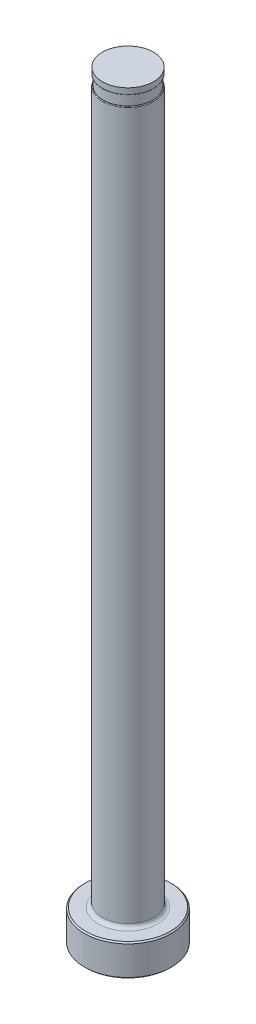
from build123d import *

# Parameters (mm, degrees)
CHAMFER1_SIZE     = 0.254
FILLET1_R         = 0.762
SKETCH2_W         = 0.2032
SKETCH2_H         = 2.032
D_SLOT_DEPTH      = 153.898684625
D_SLOT_DEPTH_BACK = 153.898684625
SKETCH5_W         = 0.01905
SKETCH5_H         = 1.27
FILLET2_R         = 0.127


with BuildPart() as part:
    # Sketch1 → Revolve1 (revolve)
    with BuildSketch(Plane.XY, mode=Mode.PRIVATE) as revolve1_sk:
        Polygon((0, 0), (-8.7249, 0), (-8.7249, 6.35), (-5.15874, 6.35), (-5.15874, 152.4), (0, 152.4), align=None)
    revolve(revolve1_sk.sketch.rotate(Axis((0, 259.958771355, 0), (0, -1, 0)), 270), axis=Axis((0, 259.958771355, 0), (0, -1, 0)))

    # Chamfer1
    chamfer1_edges = [part.edges().sort_by_distance(p)[0] for p in [
        (0, 6.35, -8.7249),
        (0, 0, -8.7249),
    ]]
    chamfer(chamfer1_edges, length=CHAMFER1_SIZE)

    # Fillet1
    fillet1_edges = [part.edges().sort_by_distance(p)[0] for p in [
        (0, 6.35, -5.15874),
    ]]
    fillet(fillet1_edges, radius=FILLET1_R)

    # Sketch2 → Vent Relief (revolve, cut)
    with BuildSketch(Plane.XY, mode=Mode.PRIVATE) as vent_relief_sk:
        with Locations((-5.05714, 150.114)):
            Rectangle(SKETCH2_W, SKETCH2_H)
    revolve(vent_relief_sk.sketch.rotate(Axis((0, 153.448281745, 0), (0, -1, 0)), 270), axis=Axis((0, 153.448281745, 0), (0, -1, 0)), mode=Mode.SUBTRACT)

    # Sketch3 → D-Slot (cut, two sides: drawn at the far end of the back side and taken through both)
    with BuildSketch(Plane.XY.offset(-D_SLOT_DEPTH_BACK)):
        with BuildLine():
            Line((-4.95554, 150.114), (-4.95554, 86.614))
            ThreePointArc((-4.95554, 86.614), (-5.006753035, 86.046038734), (-5.15874, 85.4964))
            Line((-5.15874, 85.4964), (-5.15874, 150.114))
            Line((-5.15874, 150.114), (-4.95554, 150.114))
        make_face()
    extrude(amount=D_SLOT_DEPTH + D_SLOT_DEPTH_BACK, mode=Mode.SUBTRACT)

    # Sketch5 → Vent Diameter (revolve, cut)
    with BuildSketch(Plane.XY, mode=Mode.PRIVATE) as vent_diameter_sk:
        with Locations((-5.149215, 151.765)):
            Rectangle(SKETCH5_W, SKETCH5_H)
    revolve(vent_diameter_sk.sketch.rotate(Axis((0, 152.687735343, 0), (0, -1, 0)), 90), axis=Axis((0, 152.687735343, 0), (0, -1, 0)), mode=Mode.SUBTRACT)

    # Fillet2
    fillet2_edges = [part.edges().sort_by_distance(p)[0] for p in [
        (4.123602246, 149.098, -3.099758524),
        (0, 151.13, 5.13969),
    ]]
    fillet(fillet2_edges, radius=FILLET2_R)


solid = part.part
